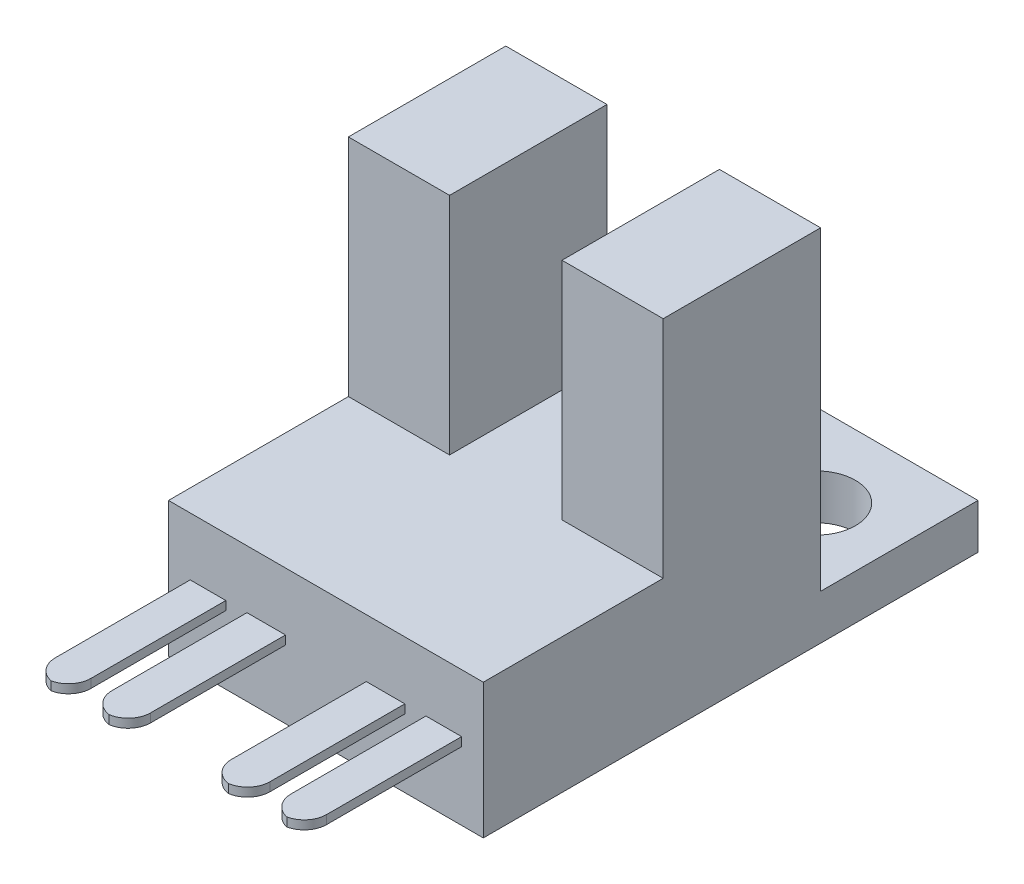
ISO-10303-21;
HEADER;
FILE_DESCRIPTION(('STEP AP214'),'2;1');
FILE_NAME('part.step','',(''),(''),'','','');
FILE_SCHEMA(('AUTOMOTIVE_DESIGN { 1 0 10303 214 1 1 1 1 }'));
ENDSEC;
DATA;
#1=APPLICATION_CONTEXT('core data for automotive mechanical design processes');
#2=APPLICATION_PROTOCOL_DEFINITION('international standard','automotive_design',2000,#1);
#3=PRODUCT_CONTEXT('',#1,'mechanical');
#4=PRODUCT('Part','Part','',(#3));
#5=PRODUCT_RELATED_PRODUCT_CATEGORY('part','',(#4));
#6=PRODUCT_DEFINITION_FORMATION('','',#4);
#7=PRODUCT_DEFINITION_CONTEXT('part definition',#1,'design');
#8=PRODUCT_DEFINITION('design','',#6,#7);
#9=PRODUCT_DEFINITION_SHAPE('','',#8);
#10=(LENGTH_UNIT() NAMED_UNIT(*) SI_UNIT(.MILLI.,.METRE.));
#11=(NAMED_UNIT(*) PLANE_ANGLE_UNIT() SI_UNIT($,.RADIAN.));
#12=(NAMED_UNIT(*) SI_UNIT($,.STERADIAN.) SOLID_ANGLE_UNIT());
#13=UNCERTAINTY_MEASURE_WITH_UNIT(LENGTH_MEASURE(1.E-05),#10,'distance_accuracy_value','');
#14=(GEOMETRIC_REPRESENTATION_CONTEXT(3) GLOBAL_UNCERTAINTY_ASSIGNED_CONTEXT((#13)) GLOBAL_UNIT_ASSIGNED_CONTEXT((#10,
#11,#12)) REPRESENTATION_CONTEXT('',''));
#15=CARTESIAN_POINT('',(0.,0.,0.));
#16=DIRECTION('',(0.,0.,1.));
#17=DIRECTION('',(1.,0.,0.));
#18=AXIS2_PLACEMENT_3D('',#15,#16,#17);
#19=CARTESIAN_POINT('',(-7.,0.,22.));
#20=DIRECTION('',(0.,0.,1.));
#21=DIRECTION('',(1.,0.,0.));
#22=AXIS2_PLACEMENT_3D('',#19,#20,#21);
#23=PLANE('',#22);
#24=DIRECTION('',(0.,-1.,0.));
#25=VECTOR('',#24,1.);
#26=CARTESIAN_POINT('',(1.79595838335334,3.42111511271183,22.));
#27=LINE('',#26,#25);
#28=CARTESIAN_POINT('',(1.79595838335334,3.42111511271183,22.));
#29=VERTEX_POINT('',#28);
#30=CARTESIAN_POINT('',(1.79595838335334,3.03279978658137,22.));
#31=VERTEX_POINT('',#30);
#32=EDGE_CURVE('E276',#29,#31,#27,.T.);
#33=ORIENTED_EDGE('',*,*,#32,.F.);
#34=DIRECTION('',(-1.,0.,0.));
#35=VECTOR('',#34,1.);
#36=CARTESIAN_POINT('',(3.5110177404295,3.42111511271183,22.));
#37=LINE('',#36,#35);
#38=CARTESIAN_POINT('',(3.5110177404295,3.42111511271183,22.));
#39=VERTEX_POINT('',#38);
#40=EDGE_CURVE('E250',#39,#29,#37,.T.);
#41=ORIENTED_EDGE('',*,*,#40,.F.);
#42=DIRECTION('',(0.,1.,0.));
#43=VECTOR('',#42,1.);
#44=CARTESIAN_POINT('',(3.5110177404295,3.42111511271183,22.));
#45=LINE('',#44,#43);
#46=CARTESIAN_POINT('',(3.5110177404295,3.03279978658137,22.));
#47=VERTEX_POINT('',#46);
#48=EDGE_CURVE('E282',#47,#39,#45,.T.);
#49=ORIENTED_EDGE('',*,*,#48,.F.);
#50=DIRECTION('',(1.,0.,0.));
#51=VECTOR('',#50,1.);
#52=CARTESIAN_POINT('',(3.5110177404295,3.03279978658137,22.));
#53=LINE('',#52,#51);
#54=EDGE_CURVE('E279',#31,#47,#53,.T.);
#55=ORIENTED_EDGE('',*,*,#54,.F.);
#56=EDGE_LOOP('',(#33,#41,#49,#55));
#57=FACE_BOUND('',#56,.T.);
#58=DIRECTION('',(1.,0.,0.));
#59=VECTOR('',#58,1.);
#60=CARTESIAN_POINT('',(-6.03506736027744,3.03279978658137,22.));
#61=LINE('',#60,#59);
#62=CARTESIAN_POINT('',(-6.03506736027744,3.03279978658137,22.));
#63=VERTEX_POINT('',#62);
#64=CARTESIAN_POINT('',(-4.44944644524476,3.03279978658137,22.));
#65=VERTEX_POINT('',#64);
#66=EDGE_CURVE('E316',#63,#65,#61,.T.);
#67=ORIENTED_EDGE('',*,*,#66,.F.);
#68=DIRECTION('',(0.,-1.,0.));
#69=VECTOR('',#68,1.);
#70=CARTESIAN_POINT('',(-6.03506736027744,3.42111511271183,22.));
#71=LINE('',#70,#69);
#72=CARTESIAN_POINT('',(-6.03506736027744,3.42111511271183,22.));
#73=VERTEX_POINT('',#72);
#74=EDGE_CURVE('E313',#73,#63,#71,.T.);
#75=ORIENTED_EDGE('',*,*,#74,.F.);
#76=DIRECTION('',(-1.,0.,0.));
#77=VECTOR('',#76,1.);
#78=CARTESIAN_POINT('',(-6.03506736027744,3.42111511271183,22.));
#79=LINE('',#78,#77);
#80=CARTESIAN_POINT('',(-4.44944644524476,3.42111511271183,22.));
#81=VERTEX_POINT('',#80);
#82=EDGE_CURVE('E322',#81,#73,#79,.T.);
#83=ORIENTED_EDGE('',*,*,#82,.F.);
#84=DIRECTION('',(0.,1.,0.));
#85=VECTOR('',#84,1.);
#86=CARTESIAN_POINT('',(-4.44944644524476,3.42111511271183,22.));
#87=LINE('',#86,#85);
#88=EDGE_CURVE('E319',#65,#81,#87,.T.);
#89=ORIENTED_EDGE('',*,*,#88,.F.);
#90=EDGE_LOOP('',(#67,#75,#83,#89));
#91=FACE_BOUND('',#90,.T.);
#92=DIRECTION('',(0.,1.,0.));
#93=VECTOR('',#92,1.);
#94=CARTESIAN_POINT('',(7.,16.,22.));
#95=LINE('',#94,#93);
#96=CARTESIAN_POINT('',(7.,0.,22.));
#97=VERTEX_POINT('',#96);
#98=CARTESIAN_POINT('',(7.,6.,22.));
#99=VERTEX_POINT('',#98);
#100=EDGE_CURVE('E412',#97,#99,#95,.T.);
#101=ORIENTED_EDGE('',*,*,#100,.T.);
#102=DIRECTION('',(-1.,0.,0.));
#103=VECTOR('',#102,1.);
#104=CARTESIAN_POINT('',(-7.,6.,22.));
#105=LINE('',#104,#103);
#106=CARTESIAN_POINT('',(-7.,6.,22.));
#107=VERTEX_POINT('',#106);
#108=EDGE_CURVE('E431',#99,#107,#105,.T.);
#109=ORIENTED_EDGE('',*,*,#108,.T.);
#110=DIRECTION('',(0.,-1.,0.));
#111=VECTOR('',#110,1.);
#112=CARTESIAN_POINT('',(-7.,16.,22.));
#113=LINE('',#112,#111);
#114=CARTESIAN_POINT('',(-7.,0.,22.));
#115=VERTEX_POINT('',#114);
#116=EDGE_CURVE('E407',#107,#115,#113,.T.);
#117=ORIENTED_EDGE('',*,*,#116,.T.);
#118=DIRECTION('',(1.,0.,0.));
#119=VECTOR('',#118,1.);
#120=CARTESIAN_POINT('',(-7.,0.,22.));
#121=LINE('',#120,#119);
#122=EDGE_CURVE('E409',#115,#97,#121,.T.);
#123=ORIENTED_EDGE('',*,*,#122,.T.);
#124=EDGE_LOOP('',(#101,#109,#117,#123));
#125=FACE_BOUND('',#124,.T.);
#126=DIRECTION('',(1.,0.,0.));
#127=VECTOR('',#126,1.);
#128=CARTESIAN_POINT('',(-3.5110177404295,3.03279978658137,22.));
#129=LINE('',#128,#127);
#130=CARTESIAN_POINT('',(-3.5110177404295,3.03279978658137,22.));
#131=VERTEX_POINT('',#130);
#132=CARTESIAN_POINT('',(-1.79595838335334,3.03279978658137,22.));
#133=VERTEX_POINT('',#132);
#134=EDGE_CURVE('E296',#131,#133,#129,.T.);
#135=ORIENTED_EDGE('',*,*,#134,.F.);
#136=DIRECTION('',(0.,-1.,0.));
#137=VECTOR('',#136,1.);
#138=CARTESIAN_POINT('',(-3.5110177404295,3.42111511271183,22.));
#139=LINE('',#138,#137);
#140=CARTESIAN_POINT('',(-3.5110177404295,3.42111511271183,22.));
#141=VERTEX_POINT('',#140);
#142=EDGE_CURVE('E293',#141,#131,#139,.T.);
#143=ORIENTED_EDGE('',*,*,#142,.F.);
#144=DIRECTION('',(-1.,0.,0.));
#145=VECTOR('',#144,1.);
#146=CARTESIAN_POINT('',(-3.5110177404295,3.42111511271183,22.));
#147=LINE('',#146,#145);
#148=CARTESIAN_POINT('',(-1.79595838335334,3.42111511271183,22.));
#149=VERTEX_POINT('',#148);
#150=EDGE_CURVE('E302',#149,#141,#147,.T.);
#151=ORIENTED_EDGE('',*,*,#150,.F.);
#152=DIRECTION('',(0.,1.,0.));
#153=VECTOR('',#152,1.);
#154=CARTESIAN_POINT('',(-1.79595838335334,3.42111511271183,22.));
#155=LINE('',#154,#153);
#156=EDGE_CURVE('E299',#133,#149,#155,.T.);
#157=ORIENTED_EDGE('',*,*,#156,.F.);
#158=EDGE_LOOP('',(#135,#143,#151,#157));
#159=FACE_BOUND('',#158,.T.);
#160=DIRECTION('',(0.,-1.,0.));
#161=VECTOR('',#160,1.);
#162=CARTESIAN_POINT('',(4.44944644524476,3.42111511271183,22.));
#163=LINE('',#162,#161);
#164=CARTESIAN_POINT('',(4.44944644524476,3.42111511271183,22.));
#165=VERTEX_POINT('',#164);
#166=CARTESIAN_POINT('',(4.44944644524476,3.03279978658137,22.));
#167=VERTEX_POINT('',#166);
#168=EDGE_CURVE('E244',#165,#167,#163,.T.);
#169=ORIENTED_EDGE('',*,*,#168,.F.);
#170=DIRECTION('',(-1.,0.,0.));
#171=VECTOR('',#170,1.);
#172=CARTESIAN_POINT('',(6.03506736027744,3.42111511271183,22.));
#173=LINE('',#172,#171);
#174=CARTESIAN_POINT('',(6.03506736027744,3.42111511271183,22.));
#175=VERTEX_POINT('',#174);
#176=EDGE_CURVE('E254',#175,#165,#173,.T.);
#177=ORIENTED_EDGE('',*,*,#176,.F.);
#178=DIRECTION('',(0.,1.,0.));
#179=VECTOR('',#178,1.);
#180=CARTESIAN_POINT('',(6.03506736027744,3.42111511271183,22.));
#181=LINE('',#180,#179);
#182=CARTESIAN_POINT('',(6.03506736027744,3.03279978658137,22.));
#183=VERTEX_POINT('',#182);
#184=EDGE_CURVE('E266',#183,#175,#181,.T.);
#185=ORIENTED_EDGE('',*,*,#184,.F.);
#186=DIRECTION('',(1.,0.,0.));
#187=VECTOR('',#186,1.);
#188=CARTESIAN_POINT('',(6.03506736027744,3.03279978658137,22.));
#189=LINE('',#188,#187);
#190=EDGE_CURVE('E264',#167,#183,#189,.T.);
#191=ORIENTED_EDGE('',*,*,#190,.F.);
#192=EDGE_LOOP('',(#169,#177,#185,#191));
#193=FACE_BOUND('',#192,.T.);
#194=ADVANCED_FACE('F32',(#57,#91,#125,#159,#193),#23,.T.);
#195=CARTESIAN_POINT('',(-7.,16.,22.));
#196=DIRECTION('',(0.,-1.,0.));
#197=DIRECTION('',(0.,0.,-1.));
#198=AXIS2_PLACEMENT_3D('',#195,#196,#197);
#199=PLANE('',#198);
#200=DIRECTION('',(-1.,0.,0.));
#201=VECTOR('',#200,1.);
#202=CARTESIAN_POINT('',(-10.2860660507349,16.,14.));
#203=LINE('',#202,#201);
#204=CARTESIAN_POINT('',(-2.5,16.,14.));
#205=VERTEX_POINT('',#204);
#206=CARTESIAN_POINT('',(-7.,16.,14.));
#207=VERTEX_POINT('',#206);
#208=EDGE_CURVE('E356',#205,#207,#203,.T.);
#209=ORIENTED_EDGE('',*,*,#208,.F.);
#210=DIRECTION('',(0.,0.,1.));
#211=VECTOR('',#210,1.);
#212=CARTESIAN_POINT('',(-2.5,16.,5.5));
#213=LINE('',#212,#211);
#214=CARTESIAN_POINT('',(-2.5,16.,7.));
#215=VERTEX_POINT('',#214);
#216=EDGE_CURVE('E333',#215,#205,#213,.T.);
#217=ORIENTED_EDGE('',*,*,#216,.F.);
#218=DIRECTION('',(1.,0.,0.));
#219=VECTOR('',#218,1.);
#220=CARTESIAN_POINT('',(-7.,16.,7.));
#221=LINE('',#220,#219);
#222=CARTESIAN_POINT('',(-7.,16.,7.));
#223=VERTEX_POINT('',#222);
#224=EDGE_CURVE('E391',#223,#215,#221,.T.);
#225=ORIENTED_EDGE('',*,*,#224,.F.);
#226=DIRECTION('',(0.,0.,-1.));
#227=VECTOR('',#226,1.);
#228=CARTESIAN_POINT('',(-7.,16.,22.));
#229=LINE('',#228,#227);
#230=EDGE_CURVE('E415',#207,#223,#229,.T.);
#231=ORIENTED_EDGE('',*,*,#230,.F.);
#232=EDGE_LOOP('',(#209,#217,#225,#231));
#233=FACE_BOUND('',#232,.T.);
#234=ADVANCED_FACE('F524',(#233),#199,.F.);
#235=CARTESIAN_POINT('',(-10.2860660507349,6.,14.));
#236=DIRECTION('',(0.,0.,-1.));
#237=DIRECTION('',(-1.,0.,0.));
#238=AXIS2_PLACEMENT_3D('',#235,#236,#237);
#239=PLANE('',#238);
#240=DIRECTION('',(-1.,0.,0.));
#241=VECTOR('',#240,1.);
#242=CARTESIAN_POINT('',(-10.2860660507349,6.,14.));
#243=LINE('',#242,#241);
#244=CARTESIAN_POINT('',(-2.5,6.,14.));
#245=VERTEX_POINT('',#244);
#246=CARTESIAN_POINT('',(-7.,6.,14.));
#247=VERTEX_POINT('',#246);
#248=EDGE_CURVE('E361',#245,#247,#243,.T.);
#249=ORIENTED_EDGE('',*,*,#248,.F.);
#250=DIRECTION('',(0.,1.,0.));
#251=VECTOR('',#250,1.);
#252=CARTESIAN_POINT('',(-2.5,6.,14.));
#253=LINE('',#252,#251);
#254=EDGE_CURVE('E348',#245,#205,#253,.T.);
#255=ORIENTED_EDGE('',*,*,#254,.T.);
#256=ORIENTED_EDGE('',*,*,#208,.T.);
#257=DIRECTION('',(0.,1.,0.));
#258=VECTOR('',#257,1.);
#259=CARTESIAN_POINT('',(-7.,16.,14.));
#260=LINE('',#259,#258);
#261=EDGE_CURVE('E371',#247,#207,#260,.T.);
#262=ORIENTED_EDGE('',*,*,#261,.F.);
#263=EDGE_LOOP('',(#249,#255,#256,#262));
#264=FACE_BOUND('',#263,.T.);
#265=ADVANCED_FACE('F530',(#264),#239,.F.);
#266=CARTESIAN_POINT('',(-7.,0.,0.));
#267=DIRECTION('',(0.,0.,1.));
#268=DIRECTION('',(1.,0.,0.));
#269=AXIS2_PLACEMENT_3D('',#266,#267,#268);
#270=PLANE('',#269);
#271=DIRECTION('',(-1.,0.,0.));
#272=VECTOR('',#271,1.);
#273=CARTESIAN_POINT('',(-7.,2.,0.));
#274=LINE('',#273,#272);
#275=CARTESIAN_POINT('',(7.,2.,0.));
#276=VERTEX_POINT('',#275);
#277=CARTESIAN_POINT('',(-7.,2.,0.));
#278=VERTEX_POINT('',#277);
#279=EDGE_CURVE('E396',#276,#278,#274,.T.);
#280=ORIENTED_EDGE('',*,*,#279,.F.);
#281=DIRECTION('',(0.,1.,0.));
#282=VECTOR('',#281,1.);
#283=CARTESIAN_POINT('',(7.,16.,0.));
#284=LINE('',#283,#282);
#285=CARTESIAN_POINT('',(7.,0.,0.));
#286=VERTEX_POINT('',#285);
#287=EDGE_CURVE('E410',#286,#276,#284,.T.);
#288=ORIENTED_EDGE('',*,*,#287,.F.);
#289=DIRECTION('',(1.,0.,0.));
#290=VECTOR('',#289,1.);
#291=CARTESIAN_POINT('',(-7.,0.,0.));
#292=LINE('',#291,#290);
#293=CARTESIAN_POINT('',(-7.,0.,0.));
#294=VERTEX_POINT('',#293);
#295=EDGE_CURVE('E417',#294,#286,#292,.T.);
#296=ORIENTED_EDGE('',*,*,#295,.F.);
#297=DIRECTION('',(0.,-1.,0.));
#298=VECTOR('',#297,1.);
#299=CARTESIAN_POINT('',(-7.,16.,0.));
#300=LINE('',#299,#298);
#301=EDGE_CURVE('E404',#278,#294,#300,.T.);
#302=ORIENTED_EDGE('',*,*,#301,.F.);
#303=EDGE_LOOP('',(#280,#288,#296,#302));
#304=FACE_BOUND('',#303,.T.);
#305=ADVANCED_FACE('F539',(#304),#270,.F.);
#306=CARTESIAN_POINT('',(-7.,16.,22.));
#307=DIRECTION('',(1.,0.,0.));
#308=DIRECTION('',(0.,1.,0.));
#309=AXIS2_PLACEMENT_3D('',#306,#307,#308);
#310=PLANE('',#309);
#311=DIRECTION('',(0.,0.,1.));
#312=VECTOR('',#311,1.);
#313=CARTESIAN_POINT('',(-7.,6.,22.));
#314=LINE('',#313,#312);
#315=EDGE_CURVE('E366',#247,#107,#314,.T.);
#316=ORIENTED_EDGE('',*,*,#315,.F.);
#317=ORIENTED_EDGE('',*,*,#261,.T.);
#318=ORIENTED_EDGE('',*,*,#230,.T.);
#319=DIRECTION('',(0.,1.,0.));
#320=VECTOR('',#319,1.);
#321=CARTESIAN_POINT('',(-7.,2.,7.));
#322=LINE('',#321,#320);
#323=CARTESIAN_POINT('',(-7.,2.,7.));
#324=VERTEX_POINT('',#323);
#325=EDGE_CURVE('E398',#324,#223,#322,.T.);
#326=ORIENTED_EDGE('',*,*,#325,.F.);
#327=DIRECTION('',(0.,0.,1.));
#328=VECTOR('',#327,1.);
#329=CARTESIAN_POINT('',(-7.,2.,0.));
#330=LINE('',#329,#328);
#331=EDGE_CURVE('E387',#278,#324,#330,.T.);
#332=ORIENTED_EDGE('',*,*,#331,.F.);
#333=ORIENTED_EDGE('',*,*,#301,.T.);
#334=DIRECTION('',(0.,0.,-1.));
#335=VECTOR('',#334,1.);
#336=CARTESIAN_POINT('',(-7.,0.,22.));
#337=LINE('',#336,#335);
#338=EDGE_CURVE('E428',#115,#294,#337,.T.);
#339=ORIENTED_EDGE('',*,*,#338,.F.);
#340=ORIENTED_EDGE('',*,*,#116,.F.);
#341=EDGE_LOOP('',(#316,#317,#318,#326,#332,#333,#339,#340));
#342=FACE_BOUND('',#341,.T.);
#343=ADVANCED_FACE('F541',(#342),#310,.F.);
#344=CARTESIAN_POINT('',(-7.,0.,22.));
#345=DIRECTION('',(0.,1.,0.));
#346=DIRECTION('',(0.,0.,1.));
#347=AXIS2_PLACEMENT_3D('',#344,#345,#346);
#348=PLANE('',#347);
#349=CARTESIAN_POINT('',(3.5,0.,3.7));
#350=DIRECTION('',(0.,1.,0.));
#351=DIRECTION('',(0.,0.,1.));
#352=AXIS2_PLACEMENT_3D('',#349,#350,#351);
#353=CIRCLE('',#352,1.75);
#354=CARTESIAN_POINT('',(3.5,0.,5.45));
#355=VERTEX_POINT('',#354);
#356=EDGE_CURVE('E377',#355,#355,#353,.T.);
#357=ORIENTED_EDGE('',*,*,#356,.T.);
#358=EDGE_LOOP('',(#357));
#359=FACE_BOUND('',#358,.T.);
#360=CARTESIAN_POINT('',(-3.5,0.,3.7));
#361=DIRECTION('',(0.,1.,0.));
#362=DIRECTION('',(0.,0.,1.));
#363=AXIS2_PLACEMENT_3D('',#360,#361,#362);
#364=CIRCLE('',#363,1.75);
#365=CARTESIAN_POINT('',(-3.5,0.,5.45));
#366=VERTEX_POINT('',#365);
#367=EDGE_CURVE('E383',#366,#366,#364,.T.);
#368=ORIENTED_EDGE('',*,*,#367,.T.);
#369=EDGE_LOOP('',(#368));
#370=FACE_BOUND('',#369,.T.);
#371=ORIENTED_EDGE('',*,*,#295,.T.);
#372=DIRECTION('',(0.,0.,-1.));
#373=VECTOR('',#372,1.);
#374=CARTESIAN_POINT('',(7.,0.,22.));
#375=LINE('',#374,#373);
#376=EDGE_CURVE('E425',#97,#286,#375,.T.);
#377=ORIENTED_EDGE('',*,*,#376,.F.);
#378=ORIENTED_EDGE('',*,*,#122,.F.);
#379=ORIENTED_EDGE('',*,*,#338,.T.);
#380=EDGE_LOOP('',(#371,#377,#378,#379));
#381=FACE_BOUND('',#380,.T.);
#382=ADVANCED_FACE('F549',(#359,#370,#381),#348,.F.);
#383=CARTESIAN_POINT('',(7.,16.,22.));
#384=DIRECTION('',(-1.,0.,0.));
#385=DIRECTION('',(0.,-1.,0.));
#386=AXIS2_PLACEMENT_3D('',#383,#384,#385);
#387=PLANE('',#386);
#388=DIRECTION('',(0.,0.,-1.));
#389=VECTOR('',#388,1.);
#390=CARTESIAN_POINT('',(7.,16.,22.));
#391=LINE('',#390,#389);
#392=CARTESIAN_POINT('',(7.,16.,14.));
#393=VERTEX_POINT('',#392);
#394=CARTESIAN_POINT('',(7.,16.,7.));
#395=VERTEX_POINT('',#394);
#396=EDGE_CURVE('E422',#393,#395,#391,.T.);
#397=ORIENTED_EDGE('',*,*,#396,.F.);
#398=DIRECTION('',(0.,-1.,0.));
#399=VECTOR('',#398,1.);
#400=CARTESIAN_POINT('',(7.,16.,14.));
#401=LINE('',#400,#399);
#402=CARTESIAN_POINT('',(7.,6.,14.));
#403=VERTEX_POINT('',#402);
#404=EDGE_CURVE('E368',#393,#403,#401,.T.);
#405=ORIENTED_EDGE('',*,*,#404,.T.);
#406=DIRECTION('',(0.,0.,-1.));
#407=VECTOR('',#406,1.);
#408=CARTESIAN_POINT('',(7.,6.,22.));
#409=LINE('',#408,#407);
#410=EDGE_CURVE('E360',#99,#403,#409,.T.);
#411=ORIENTED_EDGE('',*,*,#410,.F.);
#412=ORIENTED_EDGE('',*,*,#100,.F.);
#413=ORIENTED_EDGE('',*,*,#376,.T.);
#414=ORIENTED_EDGE('',*,*,#287,.T.);
#415=DIRECTION('',(0.,0.,-1.));
#416=VECTOR('',#415,1.);
#417=CARTESIAN_POINT('',(7.,2.,0.));
#418=LINE('',#417,#416);
#419=CARTESIAN_POINT('',(7.,2.,7.));
#420=VERTEX_POINT('',#419);
#421=EDGE_CURVE('E394',#420,#276,#418,.T.);
#422=ORIENTED_EDGE('',*,*,#421,.F.);
#423=DIRECTION('',(0.,1.,0.));
#424=VECTOR('',#423,1.);
#425=CARTESIAN_POINT('',(7.,2.,7.));
#426=LINE('',#425,#424);
#427=EDGE_CURVE('E401',#420,#395,#426,.T.);
#428=ORIENTED_EDGE('',*,*,#427,.T.);
#429=EDGE_LOOP('',(#397,#405,#411,#412,#413,#414,#422,#428));
#430=FACE_BOUND('',#429,.T.);
#431=ADVANCED_FACE('F545',(#430),#387,.F.);
#432=CARTESIAN_POINT('',(2.5,16.,7.));
#433=VERTEX_POINT('',#432);
#434=EDGE_CURVE('E386',#433,#395,#221,.T.);
#435=ORIENTED_EDGE('',*,*,#434,.F.);
#436=DIRECTION('',(0.,0.,-1.));
#437=VECTOR('',#436,1.);
#438=CARTESIAN_POINT('',(2.5,16.,5.5));
#439=LINE('',#438,#437);
#440=CARTESIAN_POINT('',(2.5,16.,14.));
#441=VERTEX_POINT('',#440);
#442=EDGE_CURVE('E337',#441,#433,#439,.T.);
#443=ORIENTED_EDGE('',*,*,#442,.F.);
#444=EDGE_CURVE('E362',#393,#441,#203,.T.);
#445=ORIENTED_EDGE('',*,*,#444,.F.);
#446=ORIENTED_EDGE('',*,*,#396,.T.);
#447=EDGE_LOOP('',(#435,#443,#445,#446));
#448=FACE_BOUND('',#447,.T.);
#449=ADVANCED_FACE('F533',(#448),#199,.F.);
#450=CARTESIAN_POINT('',(-7.,2.,7.));
#451=DIRECTION('',(0.,0.,1.));
#452=DIRECTION('',(1.,0.,0.));
#453=AXIS2_PLACEMENT_3D('',#450,#451,#452);
#454=PLANE('',#453);
#455=ORIENTED_EDGE('',*,*,#224,.T.);
#456=DIRECTION('',(0.,-1.,0.));
#457=VECTOR('',#456,1.);
#458=CARTESIAN_POINT('',(-2.5,2.,7.));
#459=LINE('',#458,#457);
#460=CARTESIAN_POINT('',(-2.5,6.,7.));
#461=VERTEX_POINT('',#460);
#462=EDGE_CURVE('E351',#215,#461,#459,.T.);
#463=ORIENTED_EDGE('',*,*,#462,.T.);
#464=DIRECTION('',(-1.,0.,0.));
#465=VECTOR('',#464,1.);
#466=CARTESIAN_POINT('',(-7.,6.,7.));
#467=LINE('',#466,#465);
#468=CARTESIAN_POINT('',(2.5,6.,7.));
#469=VERTEX_POINT('',#468);
#470=EDGE_CURVE('E354',#469,#461,#467,.T.);
#471=ORIENTED_EDGE('',*,*,#470,.F.);
#472=DIRECTION('',(0.,1.,0.));
#473=VECTOR('',#472,1.);
#474=CARTESIAN_POINT('',(2.5,2.,7.));
#475=LINE('',#474,#473);
#476=EDGE_CURVE('E345',#469,#433,#475,.T.);
#477=ORIENTED_EDGE('',*,*,#476,.T.);
#478=ORIENTED_EDGE('',*,*,#434,.T.);
#479=ORIENTED_EDGE('',*,*,#427,.F.);
#480=DIRECTION('',(1.,0.,0.));
#481=VECTOR('',#480,1.);
#482=CARTESIAN_POINT('',(-7.,2.,7.));
#483=LINE('',#482,#481);
#484=EDGE_CURVE('E390',#324,#420,#483,.T.);
#485=ORIENTED_EDGE('',*,*,#484,.F.);
#486=ORIENTED_EDGE('',*,*,#325,.T.);
#487=EDGE_LOOP('',(#455,#463,#471,#477,#478,#479,#485,#486));
#488=FACE_BOUND('',#487,.T.);
#489=ADVANCED_FACE('F537',(#488),#454,.F.);
#490=CARTESIAN_POINT('',(-7.,2.,7.));
#491=DIRECTION('',(0.,1.,0.));
#492=DIRECTION('',(0.,0.,1.));
#493=AXIS2_PLACEMENT_3D('',#490,#491,#492);
#494=PLANE('',#493);
#495=CARTESIAN_POINT('',(3.5,2.,3.7));
#496=DIRECTION('',(0.,1.,0.));
#497=DIRECTION('',(0.,0.,1.));
#498=AXIS2_PLACEMENT_3D('',#495,#496,#497);
#499=CIRCLE('',#498,1.75);
#500=CARTESIAN_POINT('',(3.5,2.,5.45));
#501=VERTEX_POINT('',#500);
#502=EDGE_CURVE('E374',#501,#501,#499,.T.);
#503=ORIENTED_EDGE('',*,*,#502,.F.);
#504=EDGE_LOOP('',(#503));
#505=FACE_BOUND('',#504,.T.);
#506=CARTESIAN_POINT('',(-3.5,2.,3.7));
#507=DIRECTION('',(0.,1.,0.));
#508=DIRECTION('',(0.,0.,1.));
#509=AXIS2_PLACEMENT_3D('',#506,#507,#508);
#510=CIRCLE('',#509,1.75);
#511=CARTESIAN_POINT('',(-3.5,2.,5.45));
#512=VERTEX_POINT('',#511);
#513=EDGE_CURVE('E380',#512,#512,#510,.T.);
#514=ORIENTED_EDGE('',*,*,#513,.F.);
#515=EDGE_LOOP('',(#514));
#516=FACE_BOUND('',#515,.T.);
#517=ORIENTED_EDGE('',*,*,#331,.T.);
#518=ORIENTED_EDGE('',*,*,#484,.T.);
#519=ORIENTED_EDGE('',*,*,#421,.T.);
#520=ORIENTED_EDGE('',*,*,#279,.T.);
#521=EDGE_LOOP('',(#517,#518,#519,#520));
#522=FACE_BOUND('',#521,.T.);
#523=ADVANCED_FACE('F780',(#505,#516,#522),#494,.T.);
#524=CARTESIAN_POINT('',(-3.5,-13.,3.7));
#525=DIRECTION('',(0.,1.,0.));
#526=DIRECTION('',(0.,0.,1.));
#527=AXIS2_PLACEMENT_3D('',#524,#525,#526);
#528=CYLINDRICAL_SURFACE('',#527,1.75);
#529=ORIENTED_EDGE('',*,*,#513,.T.);
#530=EDGE_LOOP('',(#529));
#531=FACE_BOUND('',#530,.T.);
#532=ORIENTED_EDGE('',*,*,#367,.F.);
#533=EDGE_LOOP('',(#532));
#534=FACE_BOUND('',#533,.T.);
#535=ADVANCED_FACE('F822',(#531,#534),#528,.F.);
#536=CARTESIAN_POINT('',(3.5,-13.,3.7));
#537=DIRECTION('',(0.,1.,0.));
#538=DIRECTION('',(0.,0.,1.));
#539=AXIS2_PLACEMENT_3D('',#536,#537,#538);
#540=CYLINDRICAL_SURFACE('',#539,1.75);
#541=ORIENTED_EDGE('',*,*,#502,.T.);
#542=EDGE_LOOP('',(#541));
#543=FACE_BOUND('',#542,.T.);
#544=ORIENTED_EDGE('',*,*,#356,.F.);
#545=EDGE_LOOP('',(#544));
#546=FACE_BOUND('',#545,.T.);
#547=ADVANCED_FACE('F768',(#543,#546),#540,.F.);
#548=ORIENTED_EDGE('',*,*,#444,.T.);
#549=DIRECTION('',(0.,-1.,0.));
#550=VECTOR('',#549,1.);
#551=CARTESIAN_POINT('',(2.5,6.,14.));
#552=LINE('',#551,#550);
#553=CARTESIAN_POINT('',(2.5,6.,14.));
#554=VERTEX_POINT('',#553);
#555=EDGE_CURVE('E340',#441,#554,#552,.T.);
#556=ORIENTED_EDGE('',*,*,#555,.T.);
#557=EDGE_CURVE('E357',#403,#554,#243,.T.);
#558=ORIENTED_EDGE('',*,*,#557,.F.);
#559=ORIENTED_EDGE('',*,*,#404,.F.);
#560=EDGE_LOOP('',(#548,#556,#558,#559));
#561=FACE_BOUND('',#560,.T.);
#562=ADVANCED_FACE('F756',(#561),#239,.F.);
#563=CARTESIAN_POINT('',(-10.2860660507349,6.,26.8330919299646));
#564=DIRECTION('',(0.,1.,0.));
#565=DIRECTION('',(0.,0.,1.));
#566=AXIS2_PLACEMENT_3D('',#563,#564,#565);
#567=PLANE('',#566);
#568=ORIENTED_EDGE('',*,*,#557,.T.);
#569=DIRECTION('',(0.,0.,-1.));
#570=VECTOR('',#569,1.);
#571=CARTESIAN_POINT('',(2.5,6.,5.5));
#572=LINE('',#571,#570);
#573=EDGE_CURVE('E336',#554,#469,#572,.T.);
#574=ORIENTED_EDGE('',*,*,#573,.T.);
#575=ORIENTED_EDGE('',*,*,#470,.T.);
#576=DIRECTION('',(0.,0.,1.));
#577=VECTOR('',#576,1.);
#578=CARTESIAN_POINT('',(-2.5,6.,5.5));
#579=LINE('',#578,#577);
#580=EDGE_CURVE('E334',#461,#245,#579,.T.);
#581=ORIENTED_EDGE('',*,*,#580,.T.);
#582=ORIENTED_EDGE('',*,*,#248,.T.);
#583=ORIENTED_EDGE('',*,*,#315,.T.);
#584=ORIENTED_EDGE('',*,*,#108,.F.);
#585=ORIENTED_EDGE('',*,*,#410,.T.);
#586=EDGE_LOOP('',(#568,#574,#575,#581,#582,#583,#584,#585));
#587=FACE_BOUND('',#586,.T.);
#588=ADVANCED_FACE('F746',(#587),#567,.T.);
#589=CARTESIAN_POINT('',(-2.5,6.,5.5));
#590=DIRECTION('',(-1.,0.,0.));
#591=DIRECTION('',(0.,0.,1.));
#592=AXIS2_PLACEMENT_3D('',#589,#590,#591);
#593=PLANE('',#592);
#594=ORIENTED_EDGE('',*,*,#216,.T.);
#595=ORIENTED_EDGE('',*,*,#254,.F.);
#596=ORIENTED_EDGE('',*,*,#580,.F.);
#597=ORIENTED_EDGE('',*,*,#462,.F.);
#598=EDGE_LOOP('',(#594,#595,#596,#597));
#599=FACE_BOUND('',#598,.T.);
#600=ADVANCED_FACE('F736',(#599),#593,.F.);
#601=CARTESIAN_POINT('',(2.5,6.,5.5));
#602=DIRECTION('',(1.,0.,0.));
#603=DIRECTION('',(0.,0.,-1.));
#604=AXIS2_PLACEMENT_3D('',#601,#602,#603);
#605=PLANE('',#604);
#606=ORIENTED_EDGE('',*,*,#573,.F.);
#607=ORIENTED_EDGE('',*,*,#555,.F.);
#608=ORIENTED_EDGE('',*,*,#442,.T.);
#609=ORIENTED_EDGE('',*,*,#476,.F.);
#610=EDGE_LOOP('',(#606,#607,#608,#609));
#611=FACE_BOUND('',#610,.T.);
#612=ADVANCED_FACE('F722',(#611),#605,.F.);
#613=CARTESIAN_POINT('',(-6.03506736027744,3.42111511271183,29.));
#614=DIRECTION('',(1.,0.,0.));
#615=DIRECTION('',(0.,0.,-1.));
#616=AXIS2_PLACEMENT_3D('',#613,#614,#615);
#617=PLANE('',#616);
#618=DIRECTION('',(0.,0.,-1.));
#619=VECTOR('',#618,1.);
#620=CARTESIAN_POINT('',(-6.03506736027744,3.03279978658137,29.));
#621=LINE('',#620,#619);
#622=CARTESIAN_POINT('',(-6.03506736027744,3.03279978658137,28.));
#623=VERTEX_POINT('',#622);
#624=EDGE_CURVE('E331',#623,#63,#621,.T.);
#625=ORIENTED_EDGE('',*,*,#624,.F.);
#626=DIRECTION('',(0.,-1.,0.));
#627=VECTOR('',#626,1.);
#628=CARTESIAN_POINT('',(-6.03506736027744,3.42111511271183,28.));
#629=LINE('',#628,#627);
#630=CARTESIAN_POINT('',(-6.03506736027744,3.42111511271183,28.));
#631=VERTEX_POINT('',#630);
#632=EDGE_CURVE('E11',#623,#631,#629,.F.);
#633=ORIENTED_EDGE('',*,*,#632,.T.);
#634=DIRECTION('',(0.,0.,-1.));
#635=VECTOR('',#634,1.);
#636=CARTESIAN_POINT('',(-6.03506736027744,3.42111511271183,29.));
#637=LINE('',#636,#635);
#638=EDGE_CURVE('E325',#631,#73,#637,.T.);
#639=ORIENTED_EDGE('',*,*,#638,.T.);
#640=ORIENTED_EDGE('',*,*,#74,.T.);
#641=EDGE_LOOP('',(#625,#633,#639,#640));
#642=FACE_BOUND('',#641,.T.);
#643=ADVANCED_FACE('F501',(#642),#617,.F.);
#644=CARTESIAN_POINT('',(-6.03506736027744,3.03279978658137,29.));
#645=DIRECTION('',(0.,1.,0.));
#646=DIRECTION('',(0.,0.,1.));
#647=AXIS2_PLACEMENT_3D('',#644,#645,#646);
#648=PLANE('',#647);
#649=DIRECTION('',(0.,0.,-1.));
#650=VECTOR('',#649,1.);
#651=CARTESIAN_POINT('',(-4.44944644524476,3.03279978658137,29.));
#652=LINE('',#651,#650);
#653=CARTESIAN_POINT('',(-4.44944644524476,3.03279978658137,28.));
#654=VERTEX_POINT('',#653);
#655=EDGE_CURVE('E329',#654,#65,#652,.T.);
#656=ORIENTED_EDGE('',*,*,#655,.F.);
#657=CARTESIAN_POINT('',(-5.44944644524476,3.03279978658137,28.));
#658=DIRECTION('',(0.,1.,0.));
#659=DIRECTION('',(0.,0.,1.));
#660=AXIS2_PLACEMENT_3D('',#657,#658,#659);
#661=CIRCLE('',#660,1.);
#662=CARTESIAN_POINT('',(-5.2422569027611,3.03279978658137,28.9783008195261));
#663=VERTEX_POINT('',#662);
#664=EDGE_CURVE('E41',#654,#663,#661,.F.);
#665=ORIENTED_EDGE('',*,*,#664,.T.);
#666=CARTESIAN_POINT('',(-5.03506736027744,3.03279978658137,28.));
#667=DIRECTION('',(0.,1.,0.));
#668=DIRECTION('',(0.,0.,1.));
#669=AXIS2_PLACEMENT_3D('',#666,#667,#668);
#670=CIRCLE('',#669,1.);
#671=EDGE_CURVE('E52',#663,#623,#670,.F.);
#672=ORIENTED_EDGE('',*,*,#671,.T.);
#673=ORIENTED_EDGE('',*,*,#624,.T.);
#674=ORIENTED_EDGE('',*,*,#66,.T.);
#675=EDGE_LOOP('',(#656,#665,#672,#673,#674));
#676=FACE_BOUND('',#675,.T.);
#677=ADVANCED_FACE('F511',(#676),#648,.F.);
#678=CARTESIAN_POINT('',(-4.44944644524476,3.42111511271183,29.));
#679=DIRECTION('',(-1.,0.,0.));
#680=DIRECTION('',(0.,0.,1.));
#681=AXIS2_PLACEMENT_3D('',#678,#679,#680);
#682=PLANE('',#681);
#683=DIRECTION('',(0.,0.,-1.));
#684=VECTOR('',#683,1.);
#685=CARTESIAN_POINT('',(-4.44944644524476,3.42111511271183,29.));
#686=LINE('',#685,#684);
#687=CARTESIAN_POINT('',(-4.44944644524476,3.42111511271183,28.));
#688=VERTEX_POINT('',#687);
#689=EDGE_CURVE('E327',#688,#81,#686,.T.);
#690=ORIENTED_EDGE('',*,*,#689,.F.);
#691=DIRECTION('',(0.,1.,0.));
#692=VECTOR('',#691,1.);
#693=CARTESIAN_POINT('',(-4.44944644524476,3.03279978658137,28.));
#694=LINE('',#693,#692);
#695=EDGE_CURVE('E476',#688,#654,#694,.F.);
#696=ORIENTED_EDGE('',*,*,#695,.T.);
#697=ORIENTED_EDGE('',*,*,#655,.T.);
#698=ORIENTED_EDGE('',*,*,#88,.T.);
#699=EDGE_LOOP('',(#690,#696,#697,#698));
#700=FACE_BOUND('',#699,.T.);
#701=ADVANCED_FACE('F513',(#700),#682,.F.);
#702=CARTESIAN_POINT('',(-6.03506736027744,3.42111511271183,29.));
#703=DIRECTION('',(0.,-1.,0.));
#704=DIRECTION('',(0.,0.,-1.));
#705=AXIS2_PLACEMENT_3D('',#702,#703,#704);
#706=PLANE('',#705);
#707=CARTESIAN_POINT('',(-5.03506736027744,3.42111511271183,28.));
#708=DIRECTION('',(0.,-1.,0.));
#709=DIRECTION('',(0.,0.,-1.));
#710=AXIS2_PLACEMENT_3D('',#707,#708,#709);
#711=CIRCLE('',#710,1.);
#712=CARTESIAN_POINT('',(-5.2422569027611,3.42111511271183,28.9783008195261));
#713=VERTEX_POINT('',#712);
#714=EDGE_CURVE('E472',#631,#713,#711,.F.);
#715=ORIENTED_EDGE('',*,*,#714,.T.);
#716=CARTESIAN_POINT('',(-5.44944644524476,3.42111511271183,28.));
#717=DIRECTION('',(0.,-1.,0.));
#718=DIRECTION('',(0.,0.,-1.));
#719=AXIS2_PLACEMENT_3D('',#716,#717,#718);
#720=CIRCLE('',#719,1.);
#721=EDGE_CURVE('E474',#713,#688,#720,.F.);
#722=ORIENTED_EDGE('',*,*,#721,.T.);
#723=ORIENTED_EDGE('',*,*,#689,.T.);
#724=ORIENTED_EDGE('',*,*,#82,.T.);
#725=ORIENTED_EDGE('',*,*,#638,.F.);
#726=EDGE_LOOP('',(#715,#722,#723,#724,#725));
#727=FACE_BOUND('',#726,.T.);
#728=ADVANCED_FACE('F503',(#727),#706,.F.);
#729=CARTESIAN_POINT('',(-3.5110177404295,3.42111511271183,29.));
#730=DIRECTION('',(1.,0.,0.));
#731=DIRECTION('',(0.,0.,-1.));
#732=AXIS2_PLACEMENT_3D('',#729,#730,#731);
#733=PLANE('',#732);
#734=DIRECTION('',(0.,0.,-1.));
#735=VECTOR('',#734,1.);
#736=CARTESIAN_POINT('',(-3.5110177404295,3.03279978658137,29.));
#737=LINE('',#736,#735);
#738=CARTESIAN_POINT('',(-3.5110177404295,3.03279978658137,28.));
#739=VERTEX_POINT('',#738);
#740=EDGE_CURVE('E311',#739,#131,#737,.T.);
#741=ORIENTED_EDGE('',*,*,#740,.F.);
#742=DIRECTION('',(0.,-1.,0.));
#743=VECTOR('',#742,1.);
#744=CARTESIAN_POINT('',(-3.5110177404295,3.42111511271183,28.));
#745=LINE('',#744,#743);
#746=CARTESIAN_POINT('',(-3.5110177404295,3.42111511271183,28.));
#747=VERTEX_POINT('',#746);
#748=EDGE_CURVE('E470',#739,#747,#745,.F.);
#749=ORIENTED_EDGE('',*,*,#748,.T.);
#750=DIRECTION('',(0.,0.,-1.));
#751=VECTOR('',#750,1.);
#752=CARTESIAN_POINT('',(-3.5110177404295,3.42111511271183,29.));
#753=LINE('',#752,#751);
#754=EDGE_CURVE('E305',#747,#141,#753,.T.);
#755=ORIENTED_EDGE('',*,*,#754,.T.);
#756=ORIENTED_EDGE('',*,*,#142,.T.);
#757=EDGE_LOOP('',(#741,#749,#755,#756));
#758=FACE_BOUND('',#757,.T.);
#759=ADVANCED_FACE('F520',(#758),#733,.F.);
#760=CARTESIAN_POINT('',(-3.5110177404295,3.03279978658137,29.));
#761=DIRECTION('',(0.,1.,0.));
#762=DIRECTION('',(0.,0.,1.));
#763=AXIS2_PLACEMENT_3D('',#760,#761,#762);
#764=PLANE('',#763);
#765=DIRECTION('',(0.,0.,-1.));
#766=VECTOR('',#765,1.);
#767=CARTESIAN_POINT('',(-1.79595838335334,3.03279978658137,29.));
#768=LINE('',#767,#766);
#769=CARTESIAN_POINT('',(-1.79595838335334,3.03279978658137,28.));
#770=VERTEX_POINT('',#769);
#771=EDGE_CURVE('E309',#770,#133,#768,.T.);
#772=ORIENTED_EDGE('',*,*,#771,.F.);
#773=CARTESIAN_POINT('',(-2.79595838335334,3.03279978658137,28.));
#774=DIRECTION('',(0.,1.,0.));
#775=DIRECTION('',(0.,0.,1.));
#776=AXIS2_PLACEMENT_3D('',#773,#774,#775);
#777=CIRCLE('',#776,1.);
#778=CARTESIAN_POINT('',(-2.65348806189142,3.03279978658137,28.9897990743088));
#779=VERTEX_POINT('',#778);
#780=EDGE_CURVE('E468',#770,#779,#777,.F.);
#781=ORIENTED_EDGE('',*,*,#780,.T.);
#782=CARTESIAN_POINT('',(-2.5110177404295,3.03279978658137,28.));
#783=DIRECTION('',(0.,1.,0.));
#784=DIRECTION('',(0.,0.,1.));
#785=AXIS2_PLACEMENT_3D('',#782,#783,#784);
#786=CIRCLE('',#785,1.);
#787=EDGE_CURVE('E466',#779,#739,#786,.F.);
#788=ORIENTED_EDGE('',*,*,#787,.T.);
#789=ORIENTED_EDGE('',*,*,#740,.T.);
#790=ORIENTED_EDGE('',*,*,#134,.T.);
#791=EDGE_LOOP('',(#772,#781,#788,#789,#790));
#792=FACE_BOUND('',#791,.T.);
#793=ADVANCED_FACE('F684',(#792),#764,.F.);
#794=CARTESIAN_POINT('',(-1.79595838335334,3.42111511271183,29.));
#795=DIRECTION('',(-1.,0.,0.));
#796=DIRECTION('',(0.,0.,1.));
#797=AXIS2_PLACEMENT_3D('',#794,#795,#796);
#798=PLANE('',#797);
#799=DIRECTION('',(0.,0.,-1.));
#800=VECTOR('',#799,1.);
#801=CARTESIAN_POINT('',(-1.79595838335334,3.42111511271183,29.));
#802=LINE('',#801,#800);
#803=CARTESIAN_POINT('',(-1.79595838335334,3.42111511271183,28.));
#804=VERTEX_POINT('',#803);
#805=EDGE_CURVE('E307',#804,#149,#802,.T.);
#806=ORIENTED_EDGE('',*,*,#805,.F.);
#807=DIRECTION('',(0.,1.,0.));
#808=VECTOR('',#807,1.);
#809=CARTESIAN_POINT('',(-1.79595838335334,3.03279978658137,28.));
#810=LINE('',#809,#808);
#811=EDGE_CURVE('E463',#804,#770,#810,.F.);
#812=ORIENTED_EDGE('',*,*,#811,.T.);
#813=ORIENTED_EDGE('',*,*,#771,.T.);
#814=ORIENTED_EDGE('',*,*,#156,.T.);
#815=EDGE_LOOP('',(#806,#812,#813,#814));
#816=FACE_BOUND('',#815,.T.);
#817=ADVANCED_FACE('F676',(#816),#798,.F.);
#818=CARTESIAN_POINT('',(-3.5110177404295,3.42111511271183,29.));
#819=DIRECTION('',(0.,-1.,0.));
#820=DIRECTION('',(0.,0.,-1.));
#821=AXIS2_PLACEMENT_3D('',#818,#819,#820);
#822=PLANE('',#821);
#823=CARTESIAN_POINT('',(-2.5110177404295,3.42111511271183,28.));
#824=DIRECTION('',(0.,-1.,0.));
#825=DIRECTION('',(0.,0.,-1.));
#826=AXIS2_PLACEMENT_3D('',#823,#824,#825);
#827=CIRCLE('',#826,1.);
#828=CARTESIAN_POINT('',(-2.65348806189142,3.42111511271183,28.9897990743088));
#829=VERTEX_POINT('',#828);
#830=EDGE_CURVE('E459',#747,#829,#827,.F.);
#831=ORIENTED_EDGE('',*,*,#830,.T.);
#832=CARTESIAN_POINT('',(-2.79595838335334,3.42111511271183,28.));
#833=DIRECTION('',(0.,-1.,0.));
#834=DIRECTION('',(0.,0.,-1.));
#835=AXIS2_PLACEMENT_3D('',#832,#833,#834);
#836=CIRCLE('',#835,1.);
#837=EDGE_CURVE('E461',#829,#804,#836,.F.);
#838=ORIENTED_EDGE('',*,*,#837,.T.);
#839=ORIENTED_EDGE('',*,*,#805,.T.);
#840=ORIENTED_EDGE('',*,*,#150,.T.);
#841=ORIENTED_EDGE('',*,*,#754,.F.);
#842=EDGE_LOOP('',(#831,#838,#839,#840,#841));
#843=FACE_BOUND('',#842,.T.);
#844=ADVANCED_FACE('F668',(#843),#822,.F.);
#845=CARTESIAN_POINT('',(3.5110177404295,3.42111511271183,29.));
#846=DIRECTION('',(0.,-1.,0.));
#847=DIRECTION('',(0.,0.,-1.));
#848=AXIS2_PLACEMENT_3D('',#845,#846,#847);
#849=PLANE('',#848);
#850=CARTESIAN_POINT('',(2.79595838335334,3.42111511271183,28.));
#851=DIRECTION('',(0.,-1.,0.));
#852=DIRECTION('',(0.,0.,-1.));
#853=AXIS2_PLACEMENT_3D('',#850,#851,#852);
#854=CIRCLE('',#853,1.);
#855=CARTESIAN_POINT('',(1.79595838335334,3.42111511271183,28.));
#856=VERTEX_POINT('',#855);
#857=CARTESIAN_POINT('',(2.65348806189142,3.42111511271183,28.9897990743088));
#858=VERTEX_POINT('',#857);
#859=EDGE_CURVE('E446',#856,#858,#854,.F.);
#860=ORIENTED_EDGE('',*,*,#859,.T.);
#861=CARTESIAN_POINT('',(2.5110177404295,3.42111511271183,28.));
#862=DIRECTION('',(0.,-1.,0.));
#863=DIRECTION('',(0.,0.,-1.));
#864=AXIS2_PLACEMENT_3D('',#861,#862,#863);
#865=CIRCLE('',#864,1.);
#866=CARTESIAN_POINT('',(3.5110177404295,3.42111511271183,28.));
#867=VERTEX_POINT('',#866);
#868=EDGE_CURVE('E448',#858,#867,#865,.F.);
#869=ORIENTED_EDGE('',*,*,#868,.T.);
#870=DIRECTION('',(0.,0.,-1.));
#871=VECTOR('',#870,1.);
#872=CARTESIAN_POINT('',(3.5110177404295,3.42111511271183,29.));
#873=LINE('',#872,#871);
#874=EDGE_CURVE('E285',#867,#39,#873,.T.);
#875=ORIENTED_EDGE('',*,*,#874,.T.);
#876=ORIENTED_EDGE('',*,*,#40,.T.);
#877=DIRECTION('',(0.,0.,-1.));
#878=VECTOR('',#877,1.);
#879=CARTESIAN_POINT('',(1.79595838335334,3.42111511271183,29.));
#880=LINE('',#879,#878);
#881=EDGE_CURVE('E291',#856,#29,#880,.T.);
#882=ORIENTED_EDGE('',*,*,#881,.F.);
#883=EDGE_LOOP('',(#860,#869,#875,#876,#882));
#884=FACE_BOUND('',#883,.T.);
#885=ADVANCED_FACE('F660',(#884),#849,.F.);
#886=CARTESIAN_POINT('',(1.79595838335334,3.42111511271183,29.));
#887=DIRECTION('',(1.,0.,0.));
#888=DIRECTION('',(0.,0.,-1.));
#889=AXIS2_PLACEMENT_3D('',#886,#887,#888);
#890=PLANE('',#889);
#891=DIRECTION('',(0.,0.,-1.));
#892=VECTOR('',#891,1.);
#893=CARTESIAN_POINT('',(1.79595838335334,3.03279978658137,29.));
#894=LINE('',#893,#892);
#895=CARTESIAN_POINT('',(1.79595838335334,3.03279978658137,28.));
#896=VERTEX_POINT('',#895);
#897=EDGE_CURVE('E289',#896,#31,#894,.T.);
#898=ORIENTED_EDGE('',*,*,#897,.F.);
#899=DIRECTION('',(0.,-1.,0.));
#900=VECTOR('',#899,1.);
#901=CARTESIAN_POINT('',(1.79595838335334,3.42111511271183,28.));
#902=LINE('',#901,#900);
#903=EDGE_CURVE('E457',#896,#856,#902,.F.);
#904=ORIENTED_EDGE('',*,*,#903,.T.);
#905=ORIENTED_EDGE('',*,*,#881,.T.);
#906=ORIENTED_EDGE('',*,*,#32,.T.);
#907=EDGE_LOOP('',(#898,#904,#905,#906));
#908=FACE_BOUND('',#907,.T.);
#909=ADVANCED_FACE('F652',(#908),#890,.F.);
#910=CARTESIAN_POINT('',(3.5110177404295,3.03279978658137,29.));
#911=DIRECTION('',(0.,1.,0.));
#912=DIRECTION('',(0.,0.,1.));
#913=AXIS2_PLACEMENT_3D('',#910,#911,#912);
#914=PLANE('',#913);
#915=DIRECTION('',(0.,0.,-1.));
#916=VECTOR('',#915,1.);
#917=CARTESIAN_POINT('',(3.5110177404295,3.03279978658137,29.));
#918=LINE('',#917,#916);
#919=CARTESIAN_POINT('',(3.5110177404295,3.03279978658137,28.));
#920=VERTEX_POINT('',#919);
#921=EDGE_CURVE('E287',#920,#47,#918,.T.);
#922=ORIENTED_EDGE('',*,*,#921,.F.);
#923=CARTESIAN_POINT('',(2.5110177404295,3.03279978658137,28.));
#924=DIRECTION('',(0.,1.,0.));
#925=DIRECTION('',(0.,0.,1.));
#926=AXIS2_PLACEMENT_3D('',#923,#924,#925);
#927=CIRCLE('',#926,1.);
#928=CARTESIAN_POINT('',(2.65348806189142,3.03279978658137,28.9897990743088));
#929=VERTEX_POINT('',#928);
#930=EDGE_CURVE('E455',#920,#929,#927,.F.);
#931=ORIENTED_EDGE('',*,*,#930,.T.);
#932=CARTESIAN_POINT('',(2.79595838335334,3.03279978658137,28.));
#933=DIRECTION('',(0.,1.,0.));
#934=DIRECTION('',(0.,0.,1.));
#935=AXIS2_PLACEMENT_3D('',#932,#933,#934);
#936=CIRCLE('',#935,1.);
#937=EDGE_CURVE('E453',#929,#896,#936,.F.);
#938=ORIENTED_EDGE('',*,*,#937,.T.);
#939=ORIENTED_EDGE('',*,*,#897,.T.);
#940=ORIENTED_EDGE('',*,*,#54,.T.);
#941=EDGE_LOOP('',(#922,#931,#938,#939,#940));
#942=FACE_BOUND('',#941,.T.);
#943=ADVANCED_FACE('F644',(#942),#914,.F.);
#944=CARTESIAN_POINT('',(3.5110177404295,3.42111511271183,29.));
#945=DIRECTION('',(-1.,0.,0.));
#946=DIRECTION('',(0.,0.,1.));
#947=AXIS2_PLACEMENT_3D('',#944,#945,#946);
#948=PLANE('',#947);
#949=ORIENTED_EDGE('',*,*,#874,.F.);
#950=DIRECTION('',(0.,1.,0.));
#951=VECTOR('',#950,1.);
#952=CARTESIAN_POINT('',(3.5110177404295,3.03279978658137,28.));
#953=LINE('',#952,#951);
#954=EDGE_CURVE('E450',#867,#920,#953,.F.);
#955=ORIENTED_EDGE('',*,*,#954,.T.);
#956=ORIENTED_EDGE('',*,*,#921,.T.);
#957=ORIENTED_EDGE('',*,*,#48,.T.);
#958=EDGE_LOOP('',(#949,#955,#956,#957));
#959=FACE_BOUND('',#958,.T.);
#960=ADVANCED_FACE('F637',(#959),#948,.F.);
#961=CARTESIAN_POINT('',(6.03506736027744,3.42111511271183,29.));
#962=DIRECTION('',(0.,-1.,0.));
#963=DIRECTION('',(0.,0.,-1.));
#964=AXIS2_PLACEMENT_3D('',#961,#962,#963);
#965=PLANE('',#964);
#966=CARTESIAN_POINT('',(5.44944644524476,3.42111511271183,28.));
#967=DIRECTION('',(0.,-1.,0.));
#968=DIRECTION('',(0.,0.,-1.));
#969=AXIS2_PLACEMENT_3D('',#966,#967,#968);
#970=CIRCLE('',#969,1.);
#971=CARTESIAN_POINT('',(4.44944644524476,3.42111511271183,28.));
#972=VERTEX_POINT('',#971);
#973=CARTESIAN_POINT('',(5.2422569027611,3.42111511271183,28.9783008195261));
#974=VERTEX_POINT('',#973);
#975=EDGE_CURVE('E434',#972,#974,#970,.F.);
#976=ORIENTED_EDGE('',*,*,#975,.T.);
#977=CARTESIAN_POINT('',(5.03506736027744,3.42111511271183,28.));
#978=DIRECTION('',(0.,-1.,0.));
#979=DIRECTION('',(0.,0.,-1.));
#980=AXIS2_PLACEMENT_3D('',#977,#978,#979);
#981=CIRCLE('',#980,1.);
#982=CARTESIAN_POINT('',(6.03506736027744,3.42111511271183,28.));
#983=VERTEX_POINT('',#982);
#984=EDGE_CURVE('E436',#974,#983,#981,.F.);
#985=ORIENTED_EDGE('',*,*,#984,.T.);
#986=DIRECTION('',(0.,0.,-1.));
#987=VECTOR('',#986,1.);
#988=CARTESIAN_POINT('',(6.03506736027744,3.42111511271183,29.));
#989=LINE('',#988,#987);
#990=EDGE_CURVE('E257',#983,#175,#989,.T.);
#991=ORIENTED_EDGE('',*,*,#990,.T.);
#992=ORIENTED_EDGE('',*,*,#176,.T.);
#993=DIRECTION('',(0.,0.,-1.));
#994=VECTOR('',#993,1.);
#995=CARTESIAN_POINT('',(4.44944644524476,3.42111511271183,29.));
#996=LINE('',#995,#994);
#997=EDGE_CURVE('E239',#972,#165,#996,.T.);
#998=ORIENTED_EDGE('',*,*,#997,.F.);
#999=EDGE_LOOP('',(#976,#985,#991,#992,#998));
#1000=FACE_BOUND('',#999,.T.);
#1001=ADVANCED_FACE('F255',(#1000),#965,.F.);
#1002=CARTESIAN_POINT('',(4.44944644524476,3.42111511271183,29.));
#1003=DIRECTION('',(1.,0.,0.));
#1004=DIRECTION('',(0.,0.,-1.));
#1005=AXIS2_PLACEMENT_3D('',#1002,#1003,#1004);
#1006=PLANE('',#1005);
#1007=DIRECTION('',(0.,0.,-1.));
#1008=VECTOR('',#1007,1.);
#1009=CARTESIAN_POINT('',(4.44944644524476,3.03279978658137,29.));
#1010=LINE('',#1009,#1008);
#1011=CARTESIAN_POINT('',(4.44944644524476,3.03279978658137,28.));
#1012=VERTEX_POINT('',#1011);
#1013=EDGE_CURVE('E251',#1012,#167,#1010,.T.);
#1014=ORIENTED_EDGE('',*,*,#1013,.F.);
#1015=DIRECTION('',(0.,-1.,0.));
#1016=VECTOR('',#1015,1.);
#1017=CARTESIAN_POINT('',(4.44944644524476,3.42111511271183,28.));
#1018=LINE('',#1017,#1016);
#1019=EDGE_CURVE('E247',#1012,#972,#1018,.F.);
#1020=ORIENTED_EDGE('',*,*,#1019,.T.);
#1021=ORIENTED_EDGE('',*,*,#997,.T.);
#1022=ORIENTED_EDGE('',*,*,#168,.T.);
#1023=EDGE_LOOP('',(#1014,#1020,#1021,#1022));
#1024=FACE_BOUND('',#1023,.T.);
#1025=ADVANCED_FACE('F242',(#1024),#1006,.F.);
#1026=CARTESIAN_POINT('',(6.03506736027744,3.03279978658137,29.));
#1027=DIRECTION('',(0.,1.,0.));
#1028=DIRECTION('',(0.,0.,1.));
#1029=AXIS2_PLACEMENT_3D('',#1026,#1027,#1028);
#1030=PLANE('',#1029);
#1031=DIRECTION('',(0.,0.,-1.));
#1032=VECTOR('',#1031,1.);
#1033=CARTESIAN_POINT('',(6.03506736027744,3.03279978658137,29.));
#1034=LINE('',#1033,#1032);
#1035=CARTESIAN_POINT('',(6.03506736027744,3.03279978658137,28.));
#1036=VERTEX_POINT('',#1035);
#1037=EDGE_CURVE('E271',#1036,#183,#1034,.T.);
#1038=ORIENTED_EDGE('',*,*,#1037,.F.);
#1039=CARTESIAN_POINT('',(5.03506736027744,3.03279978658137,28.));
#1040=DIRECTION('',(0.,1.,0.));
#1041=DIRECTION('',(0.,0.,1.));
#1042=AXIS2_PLACEMENT_3D('',#1039,#1040,#1041);
#1043=CIRCLE('',#1042,1.);
#1044=CARTESIAN_POINT('',(5.2422569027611,3.03279978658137,28.9783008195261));
#1045=VERTEX_POINT('',#1044);
#1046=EDGE_CURVE('E443',#1036,#1045,#1043,.F.);
#1047=ORIENTED_EDGE('',*,*,#1046,.T.);
#1048=CARTESIAN_POINT('',(5.44944644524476,3.03279978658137,28.));
#1049=DIRECTION('',(0.,1.,0.));
#1050=DIRECTION('',(0.,0.,1.));
#1051=AXIS2_PLACEMENT_3D('',#1048,#1049,#1050);
#1052=CIRCLE('',#1051,1.);
#1053=EDGE_CURVE('E441',#1045,#1012,#1052,.F.);
#1054=ORIENTED_EDGE('',*,*,#1053,.T.);
#1055=ORIENTED_EDGE('',*,*,#1013,.T.);
#1056=ORIENTED_EDGE('',*,*,#190,.T.);
#1057=EDGE_LOOP('',(#1038,#1047,#1054,#1055,#1056));
#1058=FACE_BOUND('',#1057,.T.);
#1059=ADVANCED_FACE('F616',(#1058),#1030,.F.);
#1060=CARTESIAN_POINT('',(6.03506736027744,3.42111511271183,29.));
#1061=DIRECTION('',(-1.,0.,0.));
#1062=DIRECTION('',(0.,0.,1.));
#1063=AXIS2_PLACEMENT_3D('',#1060,#1061,#1062);
#1064=PLANE('',#1063);
#1065=ORIENTED_EDGE('',*,*,#990,.F.);
#1066=DIRECTION('',(0.,1.,0.));
#1067=VECTOR('',#1066,1.);
#1068=CARTESIAN_POINT('',(6.03506736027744,3.03279978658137,28.));
#1069=LINE('',#1068,#1067);
#1070=EDGE_CURVE('E438',#983,#1036,#1069,.F.);
#1071=ORIENTED_EDGE('',*,*,#1070,.T.);
#1072=ORIENTED_EDGE('',*,*,#1037,.T.);
#1073=ORIENTED_EDGE('',*,*,#184,.T.);
#1074=EDGE_LOOP('',(#1065,#1071,#1072,#1073));
#1075=FACE_BOUND('',#1074,.T.);
#1076=ADVANCED_FACE('F565',(#1075),#1064,.F.);
#1077=CARTESIAN_POINT('',(5.44944644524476,3.42111511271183,28.));
#1078=DIRECTION('',(0.,1.,0.));
#1079=DIRECTION('',(0.,0.,1.));
#1080=AXIS2_PLACEMENT_3D('',#1077,#1078,#1079);
#1081=CYLINDRICAL_SURFACE('',#1080,1.);
#1082=ORIENTED_EDGE('',*,*,#1019,.F.);
#1083=ORIENTED_EDGE('',*,*,#1053,.F.);
#1084=DIRECTION('',(0.,1.,0.));
#1085=VECTOR('',#1084,1.);
#1086=CARTESIAN_POINT('',(5.2422569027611,3.2269574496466,28.9783008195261));
#1087=LINE('',#1086,#1085);
#1088=EDGE_CURVE('E261',#974,#1045,#1087,.F.);
#1089=ORIENTED_EDGE('',*,*,#1088,.F.);
#1090=ORIENTED_EDGE('',*,*,#975,.F.);
#1091=EDGE_LOOP('',(#1082,#1083,#1089,#1090));
#1092=FACE_BOUND('',#1091,.T.);
#1093=ADVANCED_FACE('F561',(#1092),#1081,.T.);
#1094=CARTESIAN_POINT('',(5.03506736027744,3.42111511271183,28.));
#1095=DIRECTION('',(0.,-1.,0.));
#1096=DIRECTION('',(0.,0.,-1.));
#1097=AXIS2_PLACEMENT_3D('',#1094,#1095,#1096);
#1098=CYLINDRICAL_SURFACE('',#1097,1.);
#1099=ORIENTED_EDGE('',*,*,#1046,.F.);
#1100=ORIENTED_EDGE('',*,*,#1070,.F.);
#1101=ORIENTED_EDGE('',*,*,#984,.F.);
#1102=ORIENTED_EDGE('',*,*,#1088,.T.);
#1103=EDGE_LOOP('',(#1099,#1100,#1101,#1102));
#1104=FACE_BOUND('',#1103,.T.);
#1105=ADVANCED_FACE('F557',(#1104),#1098,.T.);
#1106=CARTESIAN_POINT('',(2.79595838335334,3.42111511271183,28.));
#1107=DIRECTION('',(0.,1.,0.));
#1108=DIRECTION('',(0.,0.,1.));
#1109=AXIS2_PLACEMENT_3D('',#1106,#1107,#1108);
#1110=CYLINDRICAL_SURFACE('',#1109,1.);
#1111=ORIENTED_EDGE('',*,*,#903,.F.);
#1112=ORIENTED_EDGE('',*,*,#937,.F.);
#1113=DIRECTION('',(0.,1.,0.));
#1114=VECTOR('',#1113,1.);
#1115=CARTESIAN_POINT('',(2.65348806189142,3.2269574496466,28.9897990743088));
#1116=LINE('',#1115,#1114);
#1117=EDGE_CURVE('E483',#858,#929,#1116,.F.);
#1118=ORIENTED_EDGE('',*,*,#1117,.F.);
#1119=ORIENTED_EDGE('',*,*,#859,.F.);
#1120=EDGE_LOOP('',(#1111,#1112,#1118,#1119));
#1121=FACE_BOUND('',#1120,.T.);
#1122=ADVANCED_FACE('F560',(#1121),#1110,.T.);
#1123=CARTESIAN_POINT('',(2.5110177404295,3.42111511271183,28.));
#1124=DIRECTION('',(0.,-1.,0.));
#1125=DIRECTION('',(0.,0.,-1.));
#1126=AXIS2_PLACEMENT_3D('',#1123,#1124,#1125);
#1127=CYLINDRICAL_SURFACE('',#1126,1.);
#1128=ORIENTED_EDGE('',*,*,#930,.F.);
#1129=ORIENTED_EDGE('',*,*,#954,.F.);
#1130=ORIENTED_EDGE('',*,*,#868,.F.);
#1131=ORIENTED_EDGE('',*,*,#1117,.T.);
#1132=EDGE_LOOP('',(#1128,#1129,#1130,#1131));
#1133=FACE_BOUND('',#1132,.T.);
#1134=ADVANCED_FACE('F567',(#1133),#1127,.T.);
#1135=CARTESIAN_POINT('',(-2.5110177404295,3.03279978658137,28.));
#1136=DIRECTION('',(0.,1.,0.));
#1137=DIRECTION('',(0.,0.,1.));
#1138=AXIS2_PLACEMENT_3D('',#1135,#1136,#1137);
#1139=CYLINDRICAL_SURFACE('',#1138,1.);
#1140=ORIENTED_EDGE('',*,*,#748,.F.);
#1141=ORIENTED_EDGE('',*,*,#787,.F.);
#1142=DIRECTION('',(0.,1.,0.));
#1143=VECTOR('',#1142,1.);
#1144=CARTESIAN_POINT('',(-2.65348806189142,3.2269574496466,28.9897990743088));
#1145=LINE('',#1144,#1143);
#1146=EDGE_CURVE('E485',#829,#779,#1145,.F.);
#1147=ORIENTED_EDGE('',*,*,#1146,.F.);
#1148=ORIENTED_EDGE('',*,*,#830,.F.);
#1149=EDGE_LOOP('',(#1140,#1141,#1147,#1148));
#1150=FACE_BOUND('',#1149,.T.);
#1151=ADVANCED_FACE('F570',(#1150),#1139,.T.);
#1152=CARTESIAN_POINT('',(-2.79595838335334,3.03279978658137,28.));
#1153=DIRECTION('',(0.,-1.,0.));
#1154=DIRECTION('',(0.,0.,-1.));
#1155=AXIS2_PLACEMENT_3D('',#1152,#1153,#1154);
#1156=CYLINDRICAL_SURFACE('',#1155,1.);
#1157=ORIENTED_EDGE('',*,*,#780,.F.);
#1158=ORIENTED_EDGE('',*,*,#811,.F.);
#1159=ORIENTED_EDGE('',*,*,#837,.F.);
#1160=ORIENTED_EDGE('',*,*,#1146,.T.);
#1161=EDGE_LOOP('',(#1157,#1158,#1159,#1160));
#1162=FACE_BOUND('',#1161,.T.);
#1163=ADVANCED_FACE('F575',(#1162),#1156,.T.);
#1164=CARTESIAN_POINT('',(-5.03506736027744,3.03279978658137,28.));
#1165=DIRECTION('',(0.,1.,0.));
#1166=DIRECTION('',(0.,0.,1.));
#1167=AXIS2_PLACEMENT_3D('',#1164,#1165,#1166);
#1168=CYLINDRICAL_SURFACE('',#1167,1.);
#1169=ORIENTED_EDGE('',*,*,#632,.F.);
#1170=ORIENTED_EDGE('',*,*,#671,.F.);
#1171=DIRECTION('',(0.,1.,0.));
#1172=VECTOR('',#1171,1.);
#1173=CARTESIAN_POINT('',(-5.2422569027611,3.2269574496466,28.9783008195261));
#1174=LINE('',#1173,#1172);
#1175=EDGE_CURVE('E36',#713,#663,#1174,.F.);
#1176=ORIENTED_EDGE('',*,*,#1175,.F.);
#1177=ORIENTED_EDGE('',*,*,#714,.F.);
#1178=EDGE_LOOP('',(#1169,#1170,#1176,#1177));
#1179=FACE_BOUND('',#1178,.T.);
#1180=ADVANCED_FACE('F34',(#1179),#1168,.T.);
#1181=CARTESIAN_POINT('',(-5.44944644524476,3.03279978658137,28.));
#1182=DIRECTION('',(0.,-1.,0.));
#1183=DIRECTION('',(0.,0.,-1.));
#1184=AXIS2_PLACEMENT_3D('',#1181,#1182,#1183);
#1185=CYLINDRICAL_SURFACE('',#1184,1.);
#1186=ORIENTED_EDGE('',*,*,#664,.F.);
#1187=ORIENTED_EDGE('',*,*,#695,.F.);
#1188=ORIENTED_EDGE('',*,*,#721,.F.);
#1189=ORIENTED_EDGE('',*,*,#1175,.T.);
#1190=EDGE_LOOP('',(#1186,#1187,#1188,#1189));
#1191=FACE_BOUND('',#1190,.T.);
#1192=ADVANCED_FACE('F494',(#1191),#1185,.T.);
#1193=CLOSED_SHELL('',(#194,#234,#265,#305,#343,#382,#431,#449,#489,#523,#535,#547,#562,#588,
#600,#612,#643,#677,#701,#728,#759,#793,#817,#844,#885,#909,#943,#960,#1001,#1025,#1059,#1076,
#1093,#1105,#1122,#1134,#1151,#1163,#1180,#1192));
#1194=MANIFOLD_SOLID_BREP('B2',#1193);
#1195=ADVANCED_BREP_SHAPE_REPRESENTATION('',(#18,#1194),#14);
#1196=SHAPE_DEFINITION_REPRESENTATION(#9,#1195);
ENDSEC;
END-ISO-10303-21;
